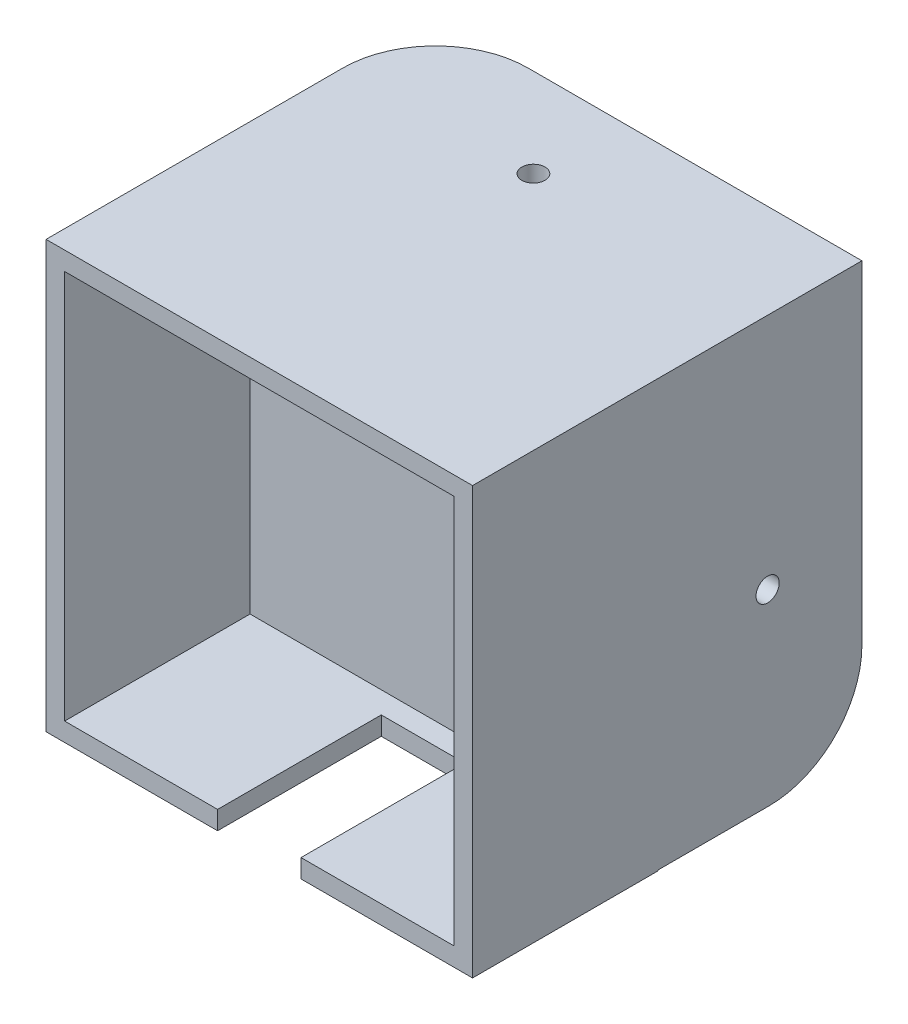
from build123d import *

# Parameters (mm, degrees)
SKETCH1_W           = 46
SKETCH1_H           = 46
SKETCH1_W_2         = 42
SKETCH1_H_2         = 42
BOSS_EXTRUDE1_DEPTH = 20
SKETCH2_W           = 46
SKETCH2_H           = 45.915924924
BOSS_EXTRUDE2_DEPTH = 2
SKETCH9_W           = 9
SKETCH9_H           = 36.840661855
CUT_EXTRUDE3_DEPTH  = 20
SKETCH17_W          = 20
SKETCH17_H          = 45.915924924
BOSS_EXTRUDE7_DEPTH = 5
SKETCH18_W          = 46
SKETCH18_H          = 20
BOSS_EXTRUDE8_DEPTH = 5
SKETCH19_R          = 1.25
CUT_EXTRUDE5_DEPTH  = 5
SKETCH20_R          = 1.25
CUT_EXTRUDE6_DEPTH  = 5
FILLET1_R           = 10


with BuildPart() as part:
    # Sketch1 → Boss-Extrude1 (new body)
    with BuildSketch(Plane.XY):
        Rectangle(SKETCH1_W, SKETCH1_H)
        Rectangle(SKETCH1_W_2, SKETCH1_H_2, mode=Mode.SUBTRACT)
    extrude(amount=BOSS_EXTRUDE1_DEPTH)

    # Sketch2 → Boss-Extrude2 (add)
    with BuildSketch(Plane(origin=(0, 0, 0), x_dir=(-1, 0, 0), z_dir=(0, 0, -1))):
        with Locations((0, 0.042037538)):
            Rectangle(SKETCH2_W, SKETCH2_H)
    extrude(amount=BOSS_EXTRUDE2_DEPTH)

    # Sketch9 → Cut-Extrude3 (cut)
    with BuildSketch(Plane.XZ.offset(23)):
        with Locations((0, 20.766778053)):
            Rectangle(SKETCH9_W, SKETCH9_H)
    extrude(amount=-CUT_EXTRUDE3_DEPTH, mode=Mode.SUBTRACT)

    # Sketch17 → Boss-Extrude7 (add)
    with BuildSketch(Plane(origin=(23, 0, 0), x_dir=(0, 0, -1), z_dir=(1, 0, 0))):
        with Locations((12, 0.042037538)):
            Rectangle(SKETCH17_W, SKETCH17_H)
    extrude(amount=-BOSS_EXTRUDE7_DEPTH)

    # Sketch18 → Boss-Extrude8 (add)
    with BuildSketch(Plane(origin=(0, 23, 0), x_dir=(1, 0, 0), z_dir=(0, 1, 0))):
        with Locations((0, 12)):
            Rectangle(SKETCH18_W, SKETCH18_H)
    extrude(amount=-BOSS_EXTRUDE8_DEPTH)

    # Sketch19 → Cut-Extrude5 (cut)
    with BuildSketch(Plane.ZY.offset(-18)):
        with Locations((-11.82842646, -2.625073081)):
            Circle(SKETCH19_R)
    extrude(amount=-CUT_EXTRUDE5_DEPTH, mode=Mode.SUBTRACT)

    # Sketch20 → Cut-Extrude6 (cut)
    with BuildSketch(Plane(origin=(0, 18, 0), x_dir=(-1, 0, 0), z_dir=(0, -1, 0))):
        with Locations(Location((2.852759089, 12.418447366, 0), (0, 0, 90))):
            Circle(SKETCH20_R)
    extrude(amount=-CUT_EXTRUDE6_DEPTH, mode=Mode.SUBTRACT)

    # Fillet1
    fillet1_edges = [part.edges().sort_by_distance(p)[0] for p in [
        (20.5, -22.915924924, -22),
        (-23, 20.5, -22),
    ]]
    fillet(fillet1_edges, radius=FILLET1_R)


solid = part.part
